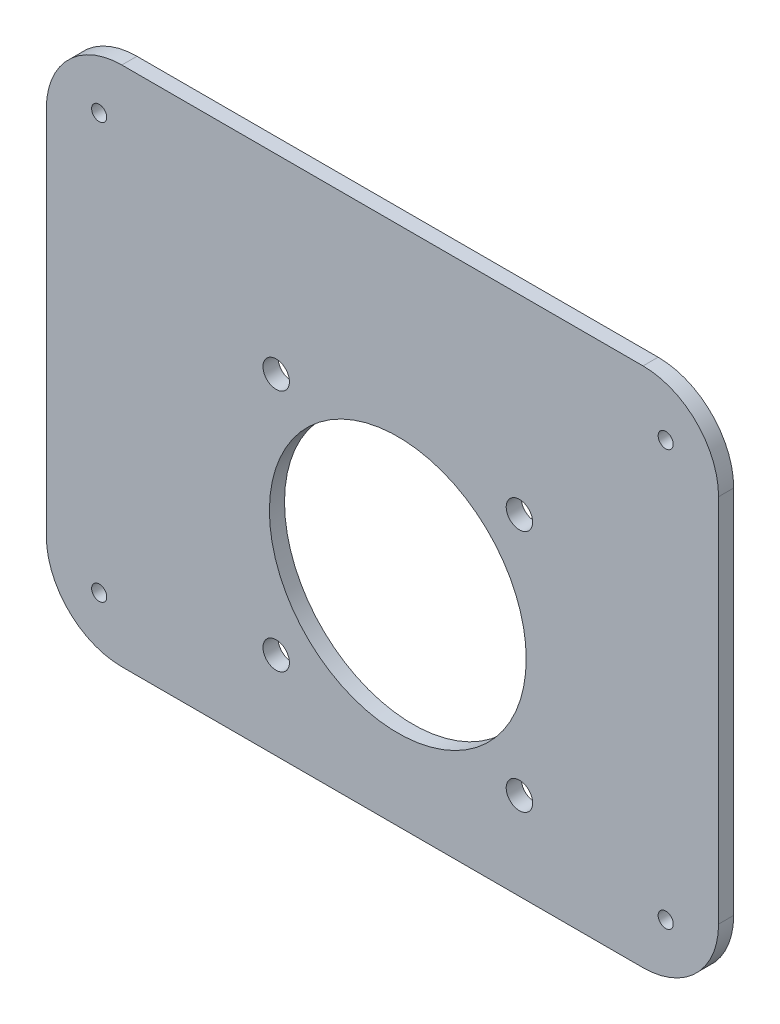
from build123d import *

# Parameters (mm, degrees)
SKETCH_1_R          = 1
EXTRUDE_1_DEPTH     = 2
CUT_EXTRUDE_1_REACH = 114.632
SKETCH_2_R          = 1.75
SKETCH_2_R_2        = 17


with BuildPart() as part:
    # Sketch 1 → Extrude 1 (new body)
    # profile 1 of 8: a face of its own
    with BuildSketch(Plane.XY):
        Polygon((44.5, 0), (10, 0), (10, -10), (0, -10), (0, -34.5), (44.5, -34.5), align=None)
    # profile 2 of 8: a face of its own
    with BuildSketch(Plane.XY):
        Polygon((79, 0), (44.5, 0), (44.5, -34.5), (89, -34.5), (89, -10), (79, -10), align=None)
    # profile 3 of 8: a face of its own
    with BuildSketch(Plane.XY):
        Polygon((44.5, -69), (44.5, -34.5), (0, -34.5), (0, -59), (10, -59), (10, -69), align=None)
    # profile 4 of 8: a face of its own
    with BuildSketch(Plane.XY):
        Polygon((89, -34.5), (44.5, -34.5), (44.5, -69), (79, -69), (79, -59), (89, -59), align=None)
    # profile 5 of 8: a face of its own
    with BuildSketch(Plane.XY):
        with BuildLine():
            Line((10, 0), (10, -10))
            Line((10, -10), (0, -10))
            ThreePointArc((0, -10), (2.928932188, -2.928932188), (10, 0))
        make_face()
        with Locations((7, -7)):
            Circle(SKETCH_1_R, mode=Mode.SUBTRACT)
    # profile 6 of 8: a face of its own
    with BuildSketch(Plane.XY):
        with BuildLine():
            ThreePointArc((79, 0), (86.071067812, -2.928932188), (89, -10))
            Line((89, -10), (79, -10))
            Line((79, -10), (79, 0))
        make_face()
        with Locations((82, -7)):
            Circle(SKETCH_1_R, mode=Mode.SUBTRACT)
    # profile 7 of 8: a face of its own
    with BuildSketch(Plane.XY):
        with BuildLine():
            Line((10, -59), (0, -59))
            ThreePointArc((0, -59), (2.928932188, -66.071067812), (10, -69))
            Line((10, -69), (10, -59))
        make_face()
        with Locations((7, -62)):
            Circle(SKETCH_1_R, mode=Mode.SUBTRACT)
    # profile 8 of 8: a face of its own
    with BuildSketch(Plane.XY):
        with BuildLine():
            Line((79, -69), (79, -59))
            Line((79, -59), (89, -59))
            ThreePointArc((89, -59), (86.071067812, -66.071067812), (79, -69))
        make_face()
        with Locations((82, -62)):
            Circle(SKETCH_1_R, mode=Mode.SUBTRACT)
    extrude(amount=-EXTRUDE_1_DEPTH)

    # Sketch 2 → Cut-Extrude 1 (cut, up to next)
    with BuildSketch(Plane.XY, mode=Mode.PRIVATE) as cut_extrude_1_sk1:
        with Locations((30.433894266, -25.230754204)):
            Circle(SKETCH_2_R)
    cut_extrude_1_tool1 = extrude(cut_extrude_1_sk1.sketch, amount=-CUT_EXTRUDE_1_REACH, mode=Mode.PRIVATE) & part.part
    # Sketch 2 → Cut-Extrude 1 (cut, up to next)
    with BuildSketch(Plane.XY, mode=Mode.PRIVATE) as cut_extrude_1_sk2:
        with Locations((62.633894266, -25.230754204)):
            Circle(SKETCH_2_R)
    cut_extrude_1_tool2 = extrude(cut_extrude_1_sk2.sketch, amount=-CUT_EXTRUDE_1_REACH, mode=Mode.PRIVATE) & part.part
    # Sketch 2 → Cut-Extrude 1 (cut, up to next)
    with BuildSketch(Plane.XY, mode=Mode.PRIVATE) as cut_extrude_1_sk3:
        with Locations((46.533894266, -41.330754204)):
            Circle(SKETCH_2_R_2)
    cut_extrude_1_tool3 = extrude(cut_extrude_1_sk3.sketch, amount=-CUT_EXTRUDE_1_REACH, mode=Mode.PRIVATE) & part.part
    # Sketch 2 → Cut-Extrude 1 (cut, up to next)
    with BuildSketch(Plane.XY, mode=Mode.PRIVATE) as cut_extrude_1_sk4:
        with Locations((30.433894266, -57.430754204)):
            Circle(SKETCH_2_R)
    cut_extrude_1_tool4 = extrude(cut_extrude_1_sk4.sketch, amount=-CUT_EXTRUDE_1_REACH, mode=Mode.PRIVATE) & part.part
    # Sketch 2 → Cut-Extrude 1 (cut, up to next)
    with BuildSketch(Plane.XY, mode=Mode.PRIVATE) as cut_extrude_1_sk5:
        with Locations((62.633894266, -57.430754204)):
            Circle(SKETCH_2_R)
    cut_extrude_1_tool5 = extrude(cut_extrude_1_sk5.sketch, amount=-CUT_EXTRUDE_1_REACH, mode=Mode.PRIVATE) & part.part
    add(cut_extrude_1_tool1.solids().sort_by_distance((30.433894, -25.230754, 0))[0], mode=Mode.SUBTRACT)
    add(cut_extrude_1_tool2.solids().sort_by_distance((62.633894, -25.230754, 0))[0], mode=Mode.SUBTRACT)
    add(cut_extrude_1_tool3.solids().sort_by_distance((46.533894, -41.330754, 0))[0], mode=Mode.SUBTRACT)
    add(cut_extrude_1_tool4.solids().sort_by_distance((30.433894, -57.430754, 0))[0], mode=Mode.SUBTRACT)
    add(cut_extrude_1_tool5.solids().sort_by_distance((62.633894, -57.430754, 0))[0], mode=Mode.SUBTRACT)


solid = part.part
